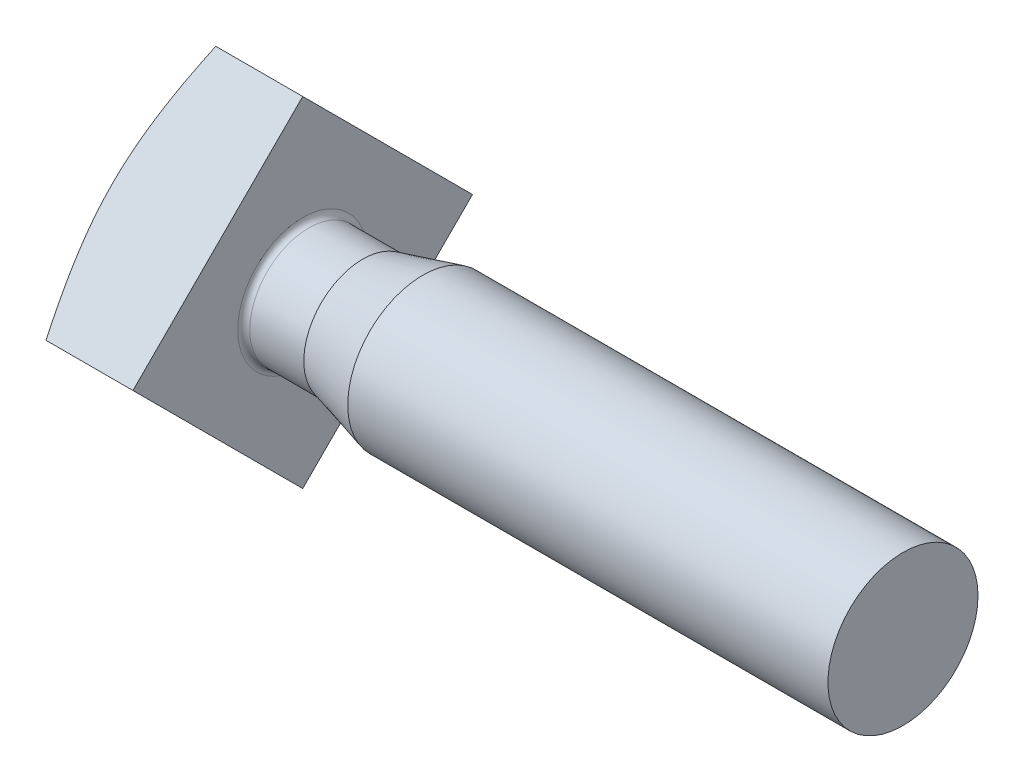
ISO-10303-21;
HEADER;
FILE_DESCRIPTION(('STEP AP214'),'2;1');
FILE_NAME('part.step','',(''),(''),'','','');
FILE_SCHEMA(('AUTOMOTIVE_DESIGN { 1 0 10303 214 1 1 1 1 }'));
ENDSEC;
DATA;
#1=APPLICATION_CONTEXT('core data for automotive mechanical design processes');
#2=APPLICATION_PROTOCOL_DEFINITION('international standard','automotive_design',2000,#1);
#3=PRODUCT_CONTEXT('',#1,'mechanical');
#4=PRODUCT('Part','Part','',(#3));
#5=PRODUCT_RELATED_PRODUCT_CATEGORY('part','',(#4));
#6=PRODUCT_DEFINITION_FORMATION('','',#4);
#7=PRODUCT_DEFINITION_CONTEXT('part definition',#1,'design');
#8=PRODUCT_DEFINITION('design','',#6,#7);
#9=PRODUCT_DEFINITION_SHAPE('','',#8);
#10=(LENGTH_UNIT() NAMED_UNIT(*) SI_UNIT(.MILLI.,.METRE.));
#11=(NAMED_UNIT(*) PLANE_ANGLE_UNIT() SI_UNIT($,.RADIAN.));
#12=(NAMED_UNIT(*) SI_UNIT($,.STERADIAN.) SOLID_ANGLE_UNIT());
#13=UNCERTAINTY_MEASURE_WITH_UNIT(LENGTH_MEASURE(1.E-05),#10,'distance_accuracy_value','');
#14=(GEOMETRIC_REPRESENTATION_CONTEXT(3) GLOBAL_UNCERTAINTY_ASSIGNED_CONTEXT((#13)) GLOBAL_UNIT_ASSIGNED_CONTEXT((#10,
#11,#12)) REPRESENTATION_CONTEXT('',''));
#15=CARTESIAN_POINT('',(0.,0.,0.));
#16=DIRECTION('',(0.,0.,1.));
#17=DIRECTION('',(1.,0.,0.));
#18=AXIS2_PLACEMENT_3D('',#15,#16,#17);
#19=CARTESIAN_POINT('',(3.5,-5.65685424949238,0.));
#20=DIRECTION('',(0.,0.707106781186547,0.707106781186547));
#21=DIRECTION('',(0.,-0.707106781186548,0.707106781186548));
#22=AXIS2_PLACEMENT_3D('',#19,#20,#21);
#23=PLANE('',#22);
#24=CARTESIAN_POINT('',(0.603118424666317,0.000199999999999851,-5.65705424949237));
#25=CARTESIAN_POINT('',(0.551325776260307,-0.142226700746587,-5.51462754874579));
#26=CARTESIAN_POINT('',(0.501273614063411,-0.284991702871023,-5.37186254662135));
#27=CARTESIAN_POINT('',(0.40586088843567,-0.571392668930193,-5.08546158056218));
#28=CARTESIAN_POINT('',(0.360503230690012,-0.715029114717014,-4.94182513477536));
#29=CARTESIAN_POINT('',(0.275564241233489,-1.00384752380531,-4.65300672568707));
#30=CARTESIAN_POINT('',(0.236010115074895,-1.14903354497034,-4.50782070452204));
#31=CARTESIAN_POINT('',(0.164536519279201,-1.44033233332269,-4.21652191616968));
#32=CARTESIAN_POINT('',(0.132615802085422,-1.58644494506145,-4.07040930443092));
#33=CARTESIAN_POINT('',(0.0788375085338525,-1.87576157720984,-3.78109267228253));
#34=CARTESIAN_POINT('',(0.0567407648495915,-2.01894294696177,-3.6379113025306));
#35=CARTESIAN_POINT('',(0.022889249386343,-2.30592555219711,-3.35092869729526));
#36=CARTESIAN_POINT('',(0.011134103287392,-2.44972676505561,-3.20712748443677));
#37=CARTESIAN_POINT('',(-0.00110589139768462,-2.73723599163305,-2.91961825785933));
#38=CARTESIAN_POINT('',(-0.00161714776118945,-2.88094343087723,-2.77591081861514));
#39=CARTESIAN_POINT('',(0.00860856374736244,-3.16815378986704,-2.48870045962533));
#40=CARTESIAN_POINT('',(0.0193453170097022,-3.31165671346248,-2.3451975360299));
#41=CARTESIAN_POINT('',(0.0455457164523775,-3.54712171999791,-2.10973252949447));
#42=CARTESIAN_POINT('',(0.0579697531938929,-3.63926129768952,-2.01759295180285));
#43=CARTESIAN_POINT('',(0.0867645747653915,-3.82322271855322,-1.83363153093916));
#44=CARTESIAN_POINT('',(0.10313506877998,-3.91504458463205,-1.74180966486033));
#45=CARTESIAN_POINT('',(0.157597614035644,-4.19020845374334,-1.46664579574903));
#46=CARTESIAN_POINT('',(0.201014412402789,-4.37302897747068,-1.28382527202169));
#47=CARTESIAN_POINT('',(0.274693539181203,-4.64774091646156,-1.00911333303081));
#48=CARTESIAN_POINT('',(0.300944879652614,-4.74019535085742,-0.916658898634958));
#49=CARTESIAN_POINT('',(0.355864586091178,-4.92474926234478,-0.732104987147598));
#50=CARTESIAN_POINT('',(0.384533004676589,-5.01684873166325,-0.640005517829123));
#51=CARTESIAN_POINT('',(0.443856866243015,-5.20047784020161,-0.456376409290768));
#52=CARTESIAN_POINT('',(0.474507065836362,-5.29200833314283,-0.364845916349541));
#53=CARTESIAN_POINT('',(0.537565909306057,-5.47475607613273,-0.182098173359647));
#54=CARTESIAN_POINT('',(0.569974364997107,-5.56597335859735,-0.0908808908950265));
#55=CARTESIAN_POINT('',(0.603118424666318,-5.65705424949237,0.000199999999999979));
#56=B_SPLINE_CURVE_WITH_KNOTS('',3,(#24,#25,#26,#27,#28,#29,#30,#31,#32,#33,#34,#35,#36,#37,#38,
#39,#40,#41,#42,#43,#44,#45,#46,#47,#48,#49,#50,#51,#52,#53,#54,#55),.UNSPECIFIED.,.F.,.F.,(4,2,
2,2,2,2,2,2,2,2,2,2,2,2,2,4),(0.,0.623959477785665,1.2483028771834,1.87548545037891,
2.50256545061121,3.11340820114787,3.72422884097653,4.33361473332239,4.94298899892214,
5.33561806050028,5.72821819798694,6.51435275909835,6.91441879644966,7.31449354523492,
7.71354996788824,8.11256376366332),.UNSPECIFIED.);
#57=CARTESIAN_POINT('',(0.603045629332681,0.,-5.65685424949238));
#58=VERTEX_POINT('',#57);
#59=CARTESIAN_POINT('',(0.,-2.82842712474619,-2.82842712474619));
#60=VERTEX_POINT('',#59);
#61=EDGE_CURVE('E138',#58,#60,#56,.T.);
#62=ORIENTED_EDGE('',*,*,#61,.F.);
#63=DIRECTION('',(-1.,0.,0.));
#64=VECTOR('',#63,1.);
#65=CARTESIAN_POINT('',(3.5,0.,-5.65685424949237));
#66=LINE('',#65,#64);
#67=CARTESIAN_POINT('',(3.5,0.,-5.65685424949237));
#68=VERTEX_POINT('',#67);
#69=EDGE_CURVE('E118',#68,#58,#66,.T.);
#70=ORIENTED_EDGE('',*,*,#69,.F.);
#71=DIRECTION('',(0.,0.707106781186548,-0.707106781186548));
#72=VECTOR('',#71,1.);
#73=CARTESIAN_POINT('',(3.5,-5.65685424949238,0.));
#74=LINE('',#73,#72);
#75=CARTESIAN_POINT('',(3.5,-5.65685424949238,0.));
#76=VERTEX_POINT('',#75);
#77=EDGE_CURVE('E199',#76,#68,#74,.T.);
#78=ORIENTED_EDGE('',*,*,#77,.F.);
#79=DIRECTION('',(-1.,0.,0.));
#80=VECTOR('',#79,1.);
#81=CARTESIAN_POINT('',(3.5,-5.65685424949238,0.));
#82=LINE('',#81,#80);
#83=CARTESIAN_POINT('',(0.603045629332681,-5.65685424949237,0.));
#84=VERTEX_POINT('',#83);
#85=EDGE_CURVE('E116',#76,#84,#82,.T.);
#86=ORIENTED_EDGE('',*,*,#85,.T.);
#87=EDGE_CURVE('E110',#60,#84,#56,.T.);
#88=ORIENTED_EDGE('',*,*,#87,.F.);
#89=EDGE_LOOP('',(#62,#70,#78,#86,#88));
#90=FACE_BOUND('',#89,.T.);
#91=ADVANCED_FACE('F36',(#90),#23,.F.);
#92=CARTESIAN_POINT('',(3.5,0.,-5.65685424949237));
#93=DIRECTION('',(0.,-0.707106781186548,0.707106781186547));
#94=DIRECTION('',(0.,-0.707106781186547,-0.707106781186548));
#95=AXIS2_PLACEMENT_3D('',#92,#93,#94);
#96=PLANE('',#95);
#97=CARTESIAN_POINT('',(0.603118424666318,5.65705424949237,0.000200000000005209));
#98=CARTESIAN_POINT('',(0.551325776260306,5.51462754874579,-0.142226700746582));
#99=CARTESIAN_POINT('',(0.501273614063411,5.37186254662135,-0.284991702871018));
#100=CARTESIAN_POINT('',(0.40586088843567,5.08546158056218,-0.571392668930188));
#101=CARTESIAN_POINT('',(0.360503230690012,4.94182513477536,-0.715029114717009));
#102=CARTESIAN_POINT('',(0.275564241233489,4.65300672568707,-1.0038475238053));
#103=CARTESIAN_POINT('',(0.236010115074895,4.50782070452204,-1.14903354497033));
#104=CARTESIAN_POINT('',(0.1645365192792,4.21652191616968,-1.44033233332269));
#105=CARTESIAN_POINT('',(0.132615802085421,4.07040930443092,-1.58644494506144));
#106=CARTESIAN_POINT('',(0.0788375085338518,3.78109267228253,-1.87576157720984));
#107=CARTESIAN_POINT('',(0.0567407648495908,3.6379113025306,-2.01894294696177));
#108=CARTESIAN_POINT('',(0.0228892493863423,3.35092869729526,-2.30592555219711));
#109=CARTESIAN_POINT('',(0.0111341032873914,3.20712748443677,-2.4497267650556));
#110=CARTESIAN_POINT('',(-0.00110589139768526,2.91961825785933,-2.73723599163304));
#111=CARTESIAN_POINT('',(-0.00161714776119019,2.77591081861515,-2.88094343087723));
#112=CARTESIAN_POINT('',(0.00860856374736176,2.48870045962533,-3.16815378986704));
#113=CARTESIAN_POINT('',(0.0193453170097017,2.3451975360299,-3.31165671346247));
#114=CARTESIAN_POINT('',(0.0455457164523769,2.10973252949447,-3.54712171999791));
#115=CARTESIAN_POINT('',(0.0579697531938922,2.01759295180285,-3.63926129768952));
#116=CARTESIAN_POINT('',(0.0867645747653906,1.83363153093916,-3.82322271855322));
#117=CARTESIAN_POINT('',(0.103135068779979,1.74180966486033,-3.91504458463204));
#118=CARTESIAN_POINT('',(0.157597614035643,1.46664579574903,-4.19020845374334));
#119=CARTESIAN_POINT('',(0.201014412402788,1.28382527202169,-4.37302897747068));
#120=CARTESIAN_POINT('',(0.274693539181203,1.00911333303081,-4.64774091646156));
#121=CARTESIAN_POINT('',(0.300944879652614,0.916658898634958,-4.74019535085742));
#122=CARTESIAN_POINT('',(0.355864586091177,0.732104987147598,-4.92474926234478));
#123=CARTESIAN_POINT('',(0.384533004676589,0.640005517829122,-5.01684873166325));
#124=CARTESIAN_POINT('',(0.443856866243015,0.456376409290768,-5.20047784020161));
#125=CARTESIAN_POINT('',(0.474507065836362,0.364845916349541,-5.29200833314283));
#126=CARTESIAN_POINT('',(0.537565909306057,0.182098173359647,-5.47475607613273));
#127=CARTESIAN_POINT('',(0.569974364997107,0.0908808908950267,-5.56597335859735));
#128=CARTESIAN_POINT('',(0.603118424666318,-0.000200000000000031,-5.65705424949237));
#129=B_SPLINE_CURVE_WITH_KNOTS('',3,(#97,#98,#99,#100,#101,#102,#103,#104,#105,#106,#107,#108,
#109,#110,#111,#112,#113,#114,#115,#116,#117,#118,#119,#120,#121,#122,#123,#124,#125,#126,#127,
#128),.UNSPECIFIED.,.F.,.F.,(4,2,2,2,2,2,2,2,2,2,2,2,2,2,2,4),(0.,0.623959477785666,
1.2483028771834,1.87548545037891,2.50256545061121,3.11340820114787,3.72422884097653,
4.33361473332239,4.94298899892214,5.33561806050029,5.72821819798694,6.51435275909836,
6.91441879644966,7.31449354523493,7.71354996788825,8.11256376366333),.UNSPECIFIED.);
#130=CARTESIAN_POINT('',(0.603045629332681,5.65685424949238,0.));
#131=VERTEX_POINT('',#130);
#132=CARTESIAN_POINT('',(0.,2.82842712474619,-2.82842712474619));
#133=VERTEX_POINT('',#132);
#134=EDGE_CURVE('E193',#131,#133,#129,.T.);
#135=ORIENTED_EDGE('',*,*,#134,.F.);
#136=DIRECTION('',(-1.,0.,0.));
#137=VECTOR('',#136,1.);
#138=CARTESIAN_POINT('',(3.5,5.65685424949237,0.));
#139=LINE('',#138,#137);
#140=CARTESIAN_POINT('',(3.5,5.65685424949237,0.));
#141=VERTEX_POINT('',#140);
#142=EDGE_CURVE('E115',#141,#131,#139,.T.);
#143=ORIENTED_EDGE('',*,*,#142,.F.);
#144=DIRECTION('',(0.,0.707106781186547,0.707106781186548));
#145=VECTOR('',#144,1.);
#146=CARTESIAN_POINT('',(3.5,0.,-5.65685424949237));
#147=LINE('',#146,#145);
#148=EDGE_CURVE('E197',#68,#141,#147,.T.);
#149=ORIENTED_EDGE('',*,*,#148,.F.);
#150=ORIENTED_EDGE('',*,*,#69,.T.);
#151=EDGE_CURVE('E151',#133,#58,#129,.T.);
#152=ORIENTED_EDGE('',*,*,#151,.F.);
#153=EDGE_LOOP('',(#135,#143,#149,#150,#152));
#154=FACE_BOUND('',#153,.T.);
#155=ADVANCED_FACE('F184',(#154),#96,.F.);
#156=CARTESIAN_POINT('',(3.5,5.65685424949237,0.));
#157=DIRECTION('',(0.,-0.707106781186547,-0.707106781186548));
#158=DIRECTION('',(0.,0.707106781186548,-0.707106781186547));
#159=AXIS2_PLACEMENT_3D('',#156,#157,#158);
#160=PLANE('',#159);
#161=CARTESIAN_POINT('',(0.603118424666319,-0.000200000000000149,5.65705424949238));
#162=CARTESIAN_POINT('',(0.551325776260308,0.142226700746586,5.51462754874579));
#163=CARTESIAN_POINT('',(0.501273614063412,0.284991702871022,5.37186254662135));
#164=CARTESIAN_POINT('',(0.405860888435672,0.571392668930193,5.08546158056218));
#165=CARTESIAN_POINT('',(0.360503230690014,0.715029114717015,4.94182513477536));
#166=CARTESIAN_POINT('',(0.275564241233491,1.00384752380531,4.65300672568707));
#167=CARTESIAN_POINT('',(0.236010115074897,1.14903354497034,4.50782070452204));
#168=CARTESIAN_POINT('',(0.164536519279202,1.44033233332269,4.21652191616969));
#169=CARTESIAN_POINT('',(0.132615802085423,1.58644494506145,4.07040930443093));
#170=CARTESIAN_POINT('',(0.0788375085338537,1.87576157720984,3.78109267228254));
#171=CARTESIAN_POINT('',(0.0567407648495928,2.01894294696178,3.6379113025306));
#172=CARTESIAN_POINT('',(0.0228892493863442,2.30592555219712,3.35092869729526));
#173=CARTESIAN_POINT('',(0.0111341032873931,2.44972676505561,3.20712748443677));
#174=CARTESIAN_POINT('',(-0.0011058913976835,2.73723599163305,2.91961825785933));
#175=CARTESIAN_POINT('',(-0.00161714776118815,2.88094343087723,2.77591081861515));
#176=CARTESIAN_POINT('',(0.00860856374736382,3.16815378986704,2.48870045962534));
#177=CARTESIAN_POINT('',(0.0193453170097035,3.31165671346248,2.3451975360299));
#178=CARTESIAN_POINT('',(0.0455457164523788,3.54712171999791,2.10973252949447));
#179=CARTESIAN_POINT('',(0.0579697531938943,3.63926129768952,2.01759295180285));
#180=CARTESIAN_POINT('',(0.0867645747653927,3.82322271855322,1.83363153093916));
#181=CARTESIAN_POINT('',(0.103135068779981,3.91504458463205,1.74180966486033));
#182=CARTESIAN_POINT('',(0.157597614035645,4.19020845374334,1.46664579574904));
#183=CARTESIAN_POINT('',(0.20101441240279,4.37302897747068,1.28382527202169));
#184=CARTESIAN_POINT('',(0.274693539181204,4.64774091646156,1.00911333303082));
#185=CARTESIAN_POINT('',(0.300944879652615,4.74019535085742,0.916658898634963));
#186=CARTESIAN_POINT('',(0.355864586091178,4.92474926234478,0.732104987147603));
#187=CARTESIAN_POINT('',(0.38453300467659,5.01684873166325,0.640005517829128));
#188=CARTESIAN_POINT('',(0.443856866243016,5.20047784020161,0.456376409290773));
#189=CARTESIAN_POINT('',(0.474507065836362,5.29200833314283,0.364845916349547));
#190=CARTESIAN_POINT('',(0.537565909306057,5.47475607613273,0.182098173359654));
#191=CARTESIAN_POINT('',(0.569974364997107,5.56597335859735,0.0908808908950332));
#192=CARTESIAN_POINT('',(0.603118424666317,5.65705424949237,-0.000199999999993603));
#193=B_SPLINE_CURVE_WITH_KNOTS('',3,(#161,#162,#163,#164,#165,#166,#167,#168,#169,#170,#171,
#172,#173,#174,#175,#176,#177,#178,#179,#180,#181,#182,#183,#184,#185,#186,#187,#188,#189,#190,
#191,#192),.UNSPECIFIED.,.F.,.F.,(4,2,2,2,2,2,2,2,2,2,2,2,2,2,2,4),(0.,0.623959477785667,
1.2483028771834,1.87548545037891,2.50256545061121,3.11340820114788,3.72422884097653,
4.33361473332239,4.94298899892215,5.33561806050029,5.72821819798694,6.51435275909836,
6.91441879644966,7.31449354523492,7.71354996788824,8.11256376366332),.UNSPECIFIED.);
#194=CARTESIAN_POINT('',(0.603045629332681,0.,5.65685424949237));
#195=VERTEX_POINT('',#194);
#196=CARTESIAN_POINT('',(0.,2.82842712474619,2.82842712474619));
#197=VERTEX_POINT('',#196);
#198=EDGE_CURVE('E93',#195,#197,#193,.T.);
#199=ORIENTED_EDGE('',*,*,#198,.F.);
#200=DIRECTION('',(-1.,0.,0.));
#201=VECTOR('',#200,1.);
#202=CARTESIAN_POINT('',(3.5,0.,5.65685424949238));
#203=LINE('',#202,#201);
#204=CARTESIAN_POINT('',(3.5,0.,5.65685424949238));
#205=VERTEX_POINT('',#204);
#206=EDGE_CURVE('E106',#205,#195,#203,.T.);
#207=ORIENTED_EDGE('',*,*,#206,.F.);
#208=DIRECTION('',(0.,-0.707106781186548,0.707106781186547));
#209=VECTOR('',#208,1.);
#210=CARTESIAN_POINT('',(3.5,5.65685424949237,0.));
#211=LINE('',#210,#209);
#212=EDGE_CURVE('E195',#141,#205,#211,.T.);
#213=ORIENTED_EDGE('',*,*,#212,.F.);
#214=ORIENTED_EDGE('',*,*,#142,.T.);
#215=EDGE_CURVE('E109',#197,#131,#193,.T.);
#216=ORIENTED_EDGE('',*,*,#215,.F.);
#217=EDGE_LOOP('',(#199,#207,#213,#214,#216));
#218=FACE_BOUND('',#217,.T.);
#219=ADVANCED_FACE('F104',(#218),#160,.F.);
#220=CARTESIAN_POINT('',(3.5,0.,5.65685424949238));
#221=DIRECTION('',(0.,0.707106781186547,-0.707106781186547));
#222=DIRECTION('',(0.,0.707106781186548,0.707106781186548));
#223=AXIS2_PLACEMENT_3D('',#220,#221,#222);
#224=PLANE('',#223);
#225=CARTESIAN_POINT('',(0.603118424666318,-5.65705424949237,-0.000199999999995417));
#226=CARTESIAN_POINT('',(0.551325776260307,-5.51462754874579,0.142226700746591));
#227=CARTESIAN_POINT('',(0.501273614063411,-5.37186254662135,0.284991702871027));
#228=CARTESIAN_POINT('',(0.40586088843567,-5.08546158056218,0.571392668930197));
#229=CARTESIAN_POINT('',(0.360503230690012,-4.94182513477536,0.715029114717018));
#230=CARTESIAN_POINT('',(0.275564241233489,-4.65300672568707,1.00384752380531));
#231=CARTESIAN_POINT('',(0.236010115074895,-4.50782070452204,1.14903354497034));
#232=CARTESIAN_POINT('',(0.164536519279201,-4.21652191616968,1.4403323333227));
#233=CARTESIAN_POINT('',(0.132615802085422,-4.07040930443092,1.58644494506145));
#234=CARTESIAN_POINT('',(0.078837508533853,-3.78109267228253,1.87576157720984));
#235=CARTESIAN_POINT('',(0.0567407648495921,-3.6379113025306,2.01894294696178));
#236=CARTESIAN_POINT('',(0.0228892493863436,-3.35092869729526,2.30592555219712));
#237=CARTESIAN_POINT('',(0.0111341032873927,-3.20712748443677,2.44972676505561));
#238=CARTESIAN_POINT('',(-0.00110589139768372,-2.91961825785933,2.73723599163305));
#239=CARTESIAN_POINT('',(-0.00161714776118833,-2.77591081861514,2.88094343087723));
#240=CARTESIAN_POINT('',(0.00860856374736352,-2.48870045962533,3.16815378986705));
#241=CARTESIAN_POINT('',(0.019345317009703,-2.3451975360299,3.31165671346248));
#242=CARTESIAN_POINT('',(0.0455457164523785,-2.10973252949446,3.54712171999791));
#243=CARTESIAN_POINT('',(0.0579697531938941,-2.01759295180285,3.63926129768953));
#244=CARTESIAN_POINT('',(0.0867645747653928,-1.83363153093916,3.82322271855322));
#245=CARTESIAN_POINT('',(0.103135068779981,-1.74180966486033,3.91504458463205));
#246=CARTESIAN_POINT('',(0.157597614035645,-1.46664579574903,4.19020845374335));
#247=CARTESIAN_POINT('',(0.201014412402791,-1.28382527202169,4.37302897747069));
#248=CARTESIAN_POINT('',(0.274693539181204,-1.00911333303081,4.64774091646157));
#249=CARTESIAN_POINT('',(0.300944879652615,-0.916658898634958,4.74019535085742));
#250=CARTESIAN_POINT('',(0.355864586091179,-0.732104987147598,4.92474926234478));
#251=CARTESIAN_POINT('',(0.384533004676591,-0.640005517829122,5.01684873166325));
#252=CARTESIAN_POINT('',(0.443856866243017,-0.456376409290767,5.20047784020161));
#253=CARTESIAN_POINT('',(0.474507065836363,-0.36484591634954,5.29200833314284));
#254=CARTESIAN_POINT('',(0.537565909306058,-0.182098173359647,5.47475607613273));
#255=CARTESIAN_POINT('',(0.569974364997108,-0.0908808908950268,5.56597335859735));
#256=CARTESIAN_POINT('',(0.603118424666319,0.00019999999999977,5.65705424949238));
#257=B_SPLINE_CURVE_WITH_KNOTS('',3,(#225,#226,#227,#228,#229,#230,#231,#232,#233,#234,#235,
#236,#237,#238,#239,#240,#241,#242,#243,#244,#245,#246,#247,#248,#249,#250,#251,#252,#253,#254,
#255,#256),.UNSPECIFIED.,.F.,.F.,(4,2,2,2,2,2,2,2,2,2,2,2,2,2,2,4),(0.,0.623959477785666,
1.2483028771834,1.87548545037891,2.50256545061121,3.11340820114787,3.72422884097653,
4.33361473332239,4.94298899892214,5.33561806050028,5.72821819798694,6.51435275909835,
6.91441879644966,7.31449354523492,7.71354996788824,8.11256376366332),.UNSPECIFIED.);
#258=CARTESIAN_POINT('',(0.,-2.82842712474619,2.82842712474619));
#259=VERTEX_POINT('',#258);
#260=EDGE_CURVE('E99',#84,#259,#257,.T.);
#261=ORIENTED_EDGE('',*,*,#260,.F.);
#262=ORIENTED_EDGE('',*,*,#85,.F.);
#263=DIRECTION('',(0.,-0.707106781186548,-0.707106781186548));
#264=VECTOR('',#263,1.);
#265=CARTESIAN_POINT('',(3.5,0.,5.65685424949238));
#266=LINE('',#265,#264);
#267=EDGE_CURVE('E114',#205,#76,#266,.T.);
#268=ORIENTED_EDGE('',*,*,#267,.F.);
#269=ORIENTED_EDGE('',*,*,#206,.T.);
#270=EDGE_CURVE('E90',#259,#195,#257,.T.);
#271=ORIENTED_EDGE('',*,*,#270,.F.);
#272=EDGE_LOOP('',(#261,#262,#268,#269,#271));
#273=FACE_BOUND('',#272,.T.);
#274=ADVANCED_FACE('F112',(#273),#224,.F.);
#275=CARTESIAN_POINT('',(3.5,-5.65685424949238,0.));
#276=DIRECTION('',(-1.,0.,0.));
#277=DIRECTION('',(0.,0.,1.));
#278=AXIS2_PLACEMENT_3D('',#275,#276,#277);
#279=PLANE('',#278);
#280=CARTESIAN_POINT('',(3.5,0.,0.));
#281=DIRECTION('',(-1.,0.,0.));
#282=DIRECTION('',(0.,0.,1.));
#283=AXIS2_PLACEMENT_3D('',#280,#281,#282);
#284=CIRCLE('',#283,2.16410161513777);
#285=CARTESIAN_POINT('',(3.5,0.,2.16410161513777));
#286=VERTEX_POINT('',#285);
#287=EDGE_CURVE('E11',#286,#286,#284,.T.);
#288=ORIENTED_EDGE('',*,*,#287,.T.);
#289=EDGE_LOOP('',(#288));
#290=FACE_BOUND('',#289,.T.);
#291=ORIENTED_EDGE('',*,*,#77,.T.);
#292=ORIENTED_EDGE('',*,*,#148,.T.);
#293=ORIENTED_EDGE('',*,*,#212,.T.);
#294=ORIENTED_EDGE('',*,*,#267,.T.);
#295=EDGE_LOOP('',(#291,#292,#293,#294));
#296=FACE_BOUND('',#295,.T.);
#297=ADVANCED_FACE('F180',(#290,#296),#279,.F.);
#298=CARTESIAN_POINT('',(0.,0.,0.));
#299=DIRECTION('',(1.,0.,0.));
#300=DIRECTION('',(0.,0.,-1.));
#301=AXIS2_PLACEMENT_3D('',#298,#299,#300);
#302=CONICAL_SURFACE('',#301,4.,1.22173047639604);
#303=ORIENTED_EDGE('',*,*,#198,.T.);
#304=CARTESIAN_POINT('',(0.,0.,0.));
#305=DIRECTION('',(-1.,0.,0.));
#306=DIRECTION('',(0.,0.,1.));
#307=AXIS2_PLACEMENT_3D('',#304,#305,#306);
#308=CIRCLE('',#307,4.);
#309=EDGE_CURVE('E94',#259,#197,#308,.T.);
#310=ORIENTED_EDGE('',*,*,#309,.F.);
#311=ORIENTED_EDGE('',*,*,#270,.T.);
#312=EDGE_LOOP('',(#303,#310,#311));
#313=FACE_BOUND('',#312,.T.);
#314=ADVANCED_FACE('F92',(#313),#302,.T.);
#315=ORIENTED_EDGE('',*,*,#87,.T.);
#316=ORIENTED_EDGE('',*,*,#260,.T.);
#317=EDGE_CURVE('E59',#60,#259,#308,.T.);
#318=ORIENTED_EDGE('',*,*,#317,.F.);
#319=EDGE_LOOP('',(#315,#316,#318));
#320=FACE_BOUND('',#319,.T.);
#321=ADVANCED_FACE('F222',(#320),#302,.T.);
#322=ORIENTED_EDGE('',*,*,#151,.T.);
#323=ORIENTED_EDGE('',*,*,#61,.T.);
#324=EDGE_CURVE('E126',#133,#60,#308,.T.);
#325=ORIENTED_EDGE('',*,*,#324,.F.);
#326=EDGE_LOOP('',(#322,#323,#325));
#327=FACE_BOUND('',#326,.T.);
#328=ADVANCED_FACE('F163',(#327),#302,.T.);
#329=ORIENTED_EDGE('',*,*,#134,.T.);
#330=CARTESIAN_POINT('',(0.,0.,0.));
#331=DIRECTION('',(-1.,0.,0.));
#332=DIRECTION('',(0.,0.,1.));
#333=AXIS2_PLACEMENT_3D('',#330,#331,#332);
#334=CIRCLE('',#333,4.);
#335=EDGE_CURVE('E51',#197,#133,#334,.T.);
#336=ORIENTED_EDGE('',*,*,#335,.F.);
#337=ORIENTED_EDGE('',*,*,#215,.T.);
#338=EDGE_LOOP('',(#329,#336,#337));
#339=FACE_BOUND('',#338,.T.);
#340=ADVANCED_FACE('F158',(#339),#302,.T.);
#341=CARTESIAN_POINT('',(0.,-5.65685424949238,0.));
#342=DIRECTION('',(-1.,0.,0.));
#343=DIRECTION('',(0.,0.,1.));
#344=AXIS2_PLACEMENT_3D('',#341,#342,#343);
#345=PLANE('',#344);
#346=CARTESIAN_POINT('',(0.,0.,0.));
#347=DIRECTION('',(-1.,0.,0.));
#348=DIRECTION('',(0.,0.,1.));
#349=AXIS2_PLACEMENT_3D('',#346,#347,#348);
#350=CIRCLE('',#349,3.6);
#351=CARTESIAN_POINT('',(0.,0.,3.6));
#352=VERTEX_POINT('',#351);
#353=EDGE_CURVE('E347',#352,#352,#350,.T.);
#354=ORIENTED_EDGE('',*,*,#353,.F.);
#355=EDGE_LOOP('',(#354));
#356=FACE_BOUND('',#355,.T.);
#357=ORIENTED_EDGE('',*,*,#309,.T.);
#358=ORIENTED_EDGE('',*,*,#335,.T.);
#359=ORIENTED_EDGE('',*,*,#324,.T.);
#360=ORIENTED_EDGE('',*,*,#317,.T.);
#361=EDGE_LOOP('',(#357,#358,#359,#360));
#362=FACE_BOUND('',#361,.T.);
#363=ADVANCED_FACE('F132',(#356,#362),#345,.T.);
#364=CARTESIAN_POINT('',(0.7,0.,0.));
#365=DIRECTION('',(-1.,0.,0.));
#366=DIRECTION('',(0.,0.,1.));
#367=AXIS2_PLACEMENT_3D('',#364,#365,#366);
#368=CYLINDRICAL_SURFACE('',#367,3.6);
#369=CARTESIAN_POINT('',(0.7,0.,0.));
#370=DIRECTION('',(-1.,0.,0.));
#371=DIRECTION('',(0.,0.,1.));
#372=AXIS2_PLACEMENT_3D('',#369,#370,#371);
#373=CIRCLE('',#372,3.6);
#374=CARTESIAN_POINT('',(0.7,0.,3.6));
#375=VERTEX_POINT('',#374);
#376=EDGE_CURVE('E351',#375,#375,#373,.T.);
#377=ORIENTED_EDGE('',*,*,#376,.F.);
#378=EDGE_LOOP('',(#377));
#379=FACE_BOUND('',#378,.T.);
#380=ORIENTED_EDGE('',*,*,#353,.T.);
#381=EDGE_LOOP('',(#380));
#382=FACE_BOUND('',#381,.T.);
#383=ADVANCED_FACE('F164',(#379,#382),#368,.F.);
#384=CARTESIAN_POINT('',(0.7,0.,0.));
#385=DIRECTION('',(-1.,0.,0.));
#386=DIRECTION('',(0.,0.,1.));
#387=AXIS2_PLACEMENT_3D('',#384,#385,#386);
#388=PLANE('',#387);
#389=ORIENTED_EDGE('',*,*,#376,.T.);
#390=EDGE_LOOP('',(#389));
#391=FACE_BOUND('',#390,.T.);
#392=ADVANCED_FACE('F246',(#391),#388,.T.);
#393=CARTESIAN_POINT('',(5.5,0.,0.));
#394=DIRECTION('',(1.,0.,0.));
#395=DIRECTION('',(0.,0.,-1.));
#396=AXIS2_PLACEMENT_3D('',#393,#394,#395);
#397=CONICAL_SURFACE('',#396,1.96410161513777,0.261799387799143);
#398=CARTESIAN_POINT('',(7.5,0.,0.));
#399=DIRECTION('',(1.,0.,0.));
#400=DIRECTION('',(0.,0.,-1.));
#401=AXIS2_PLACEMENT_3D('',#398,#399,#400);
#402=CIRCLE('',#401,2.5);
#403=CARTESIAN_POINT('',(7.5,0.,-2.5));
#404=VERTEX_POINT('',#403);
#405=EDGE_CURVE('E348',#404,#404,#402,.T.);
#406=ORIENTED_EDGE('',*,*,#405,.F.);
#407=EDGE_LOOP('',(#406));
#408=FACE_BOUND('',#407,.T.);
#409=CARTESIAN_POINT('',(5.5,0.,0.));
#410=DIRECTION('',(1.,0.,0.));
#411=DIRECTION('',(0.,0.,-1.));
#412=AXIS2_PLACEMENT_3D('',#409,#410,#411);
#413=CIRCLE('',#412,1.96410161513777);
#414=CARTESIAN_POINT('',(5.5,0.,-1.96410161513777));
#415=VERTEX_POINT('',#414);
#416=EDGE_CURVE('E345',#415,#415,#413,.T.);
#417=ORIENTED_EDGE('',*,*,#416,.T.);
#418=EDGE_LOOP('',(#417));
#419=FACE_BOUND('',#418,.T.);
#420=ADVANCED_FACE('F253',(#408,#419),#397,.T.);
#421=CARTESIAN_POINT('',(23.5,0.,0.));
#422=DIRECTION('',(1.,0.,0.));
#423=DIRECTION('',(0.,0.,-1.));
#424=AXIS2_PLACEMENT_3D('',#421,#422,#423);
#425=CYLINDRICAL_SURFACE('',#424,1.96410161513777);
#426=CARTESIAN_POINT('',(3.7,0.,0.));
#427=DIRECTION('',(-1.,0.,0.));
#428=DIRECTION('',(0.,0.,1.));
#429=AXIS2_PLACEMENT_3D('',#426,#427,#428);
#430=CIRCLE('',#429,1.96410161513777);
#431=CARTESIAN_POINT('',(3.7,0.,1.96410161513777));
#432=VERTEX_POINT('',#431);
#433=EDGE_CURVE('E44',#432,#432,#430,.F.);
#434=ORIENTED_EDGE('',*,*,#433,.T.);
#435=EDGE_LOOP('',(#434));
#436=FACE_BOUND('',#435,.T.);
#437=ORIENTED_EDGE('',*,*,#416,.F.);
#438=EDGE_LOOP('',(#437));
#439=FACE_BOUND('',#438,.T.);
#440=ADVANCED_FACE('F215',(#436,#439),#425,.T.);
#441=CARTESIAN_POINT('',(23.5,0.,0.));
#442=DIRECTION('',(1.,0.,0.));
#443=DIRECTION('',(0.,0.,-1.));
#444=AXIS2_PLACEMENT_3D('',#441,#442,#443);
#445=PLANE('',#444);
#446=CARTESIAN_POINT('',(23.5,0.,0.));
#447=DIRECTION('',(1.,0.,0.));
#448=DIRECTION('',(0.,0.,-1.));
#449=AXIS2_PLACEMENT_3D('',#446,#447,#448);
#450=CIRCLE('',#449,2.5);
#451=CARTESIAN_POINT('',(23.5,0.,-2.5));
#452=VERTEX_POINT('',#451);
#453=EDGE_CURVE('E194',#452,#452,#450,.T.);
#454=ORIENTED_EDGE('',*,*,#453,.T.);
#455=EDGE_LOOP('',(#454));
#456=FACE_BOUND('',#455,.T.);
#457=ADVANCED_FACE('F166',(#456),#445,.T.);
#458=CARTESIAN_POINT('',(23.5,0.,0.));
#459=DIRECTION('',(-1.,0.,0.));
#460=DIRECTION('',(0.,0.,1.));
#461=AXIS2_PLACEMENT_3D('',#458,#459,#460);
#462=CYLINDRICAL_SURFACE('',#461,2.5);
#463=ORIENTED_EDGE('',*,*,#405,.T.);
#464=EDGE_LOOP('',(#463));
#465=FACE_BOUND('',#464,.T.);
#466=ORIENTED_EDGE('',*,*,#453,.F.);
#467=EDGE_LOOP('',(#466));
#468=FACE_BOUND('',#467,.T.);
#469=ADVANCED_FACE('F207',(#465,#468),#462,.T.);
#470=CARTESIAN_POINT('',(3.7,0.,0.));
#471=DIRECTION('',(-1.,0.,0.));
#472=DIRECTION('',(0.,0.,1.));
#473=AXIS2_PLACEMENT_3D('',#470,#471,#472);
#474=TOROIDAL_SURFACE('',#473,2.16410161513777,0.2);
#475=ORIENTED_EDGE('',*,*,#287,.F.);
#476=EDGE_LOOP('',(#475));
#477=FACE_BOUND('',#476,.T.);
#478=ORIENTED_EDGE('',*,*,#433,.F.);
#479=EDGE_LOOP('',(#478));
#480=FACE_BOUND('',#479,.T.);
#481=ADVANCED_FACE('F38',(#477,#480),#474,.F.);
#482=CLOSED_SHELL('',(#91,#155,#219,#274,#297,#314,#321,#328,#340,#363,#383,#392,#420,#440,#457,
#469,#481));
#483=MANIFOLD_SOLID_BREP('B2',#482);
#484=ADVANCED_BREP_SHAPE_REPRESENTATION('',(#18,#483),#14);
#485=SHAPE_DEFINITION_REPRESENTATION(#9,#484);
ENDSEC;
END-ISO-10303-21;
